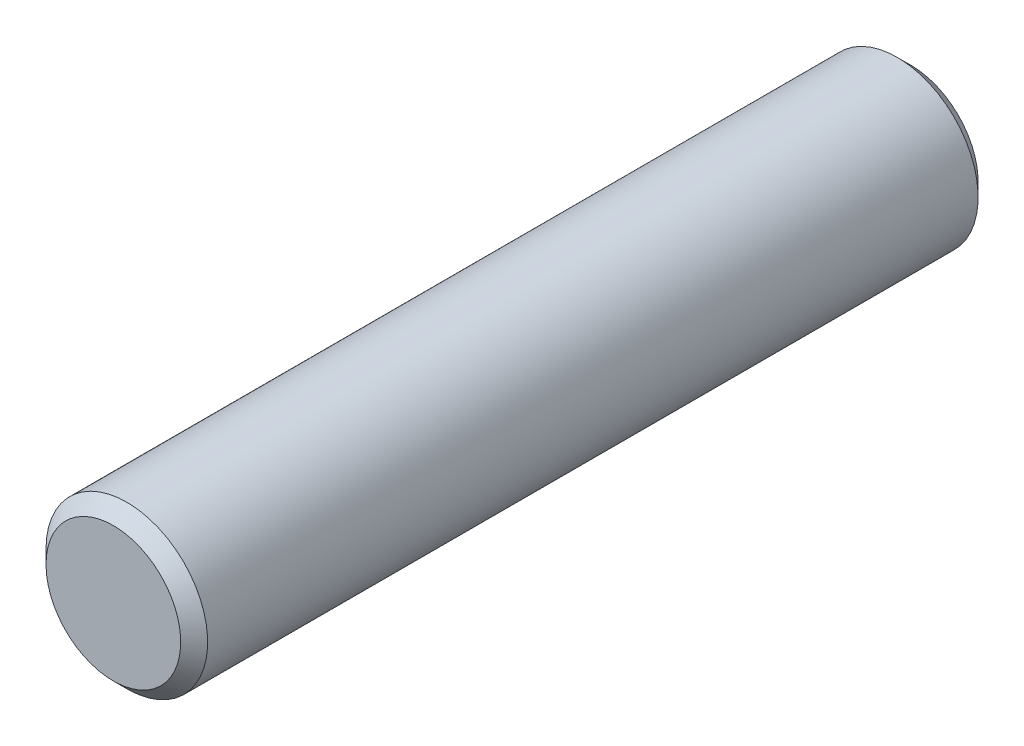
from build123d import *

# Parameters (mm, degrees)
BASE_EXTRUSION_DEPTH      = 7.4
BASE_EXTRUSION_DEPTH_BACK = 7.4
ESQUISSE1_R               = 1.5
CHANFREIN1_SIZE           = 0.25


with BuildPart() as part:
    # Esquisse1 → Base-Extrusion (new, two sides: drawn at the far end of the back side and taken through both)
    with BuildSketch(Plane.XY.offset(-BASE_EXTRUSION_DEPTH_BACK)):
        with Locations(Location((0, 0, 0), (0, 0, 180))):
            Circle(ESQUISSE1_R)
    extrude(amount=BASE_EXTRUSION_DEPTH + BASE_EXTRUSION_DEPTH_BACK)

    # Chanfrein1
    chanfrein1_edges = [part.edges().sort_by_distance(p)[0] for p in [
        (1.5, 0, 7.4),
        (1.5, 0, -7.4),
    ]]
    chamfer(chanfrein1_edges, length=CHANFREIN1_SIZE)


solid = part.part
